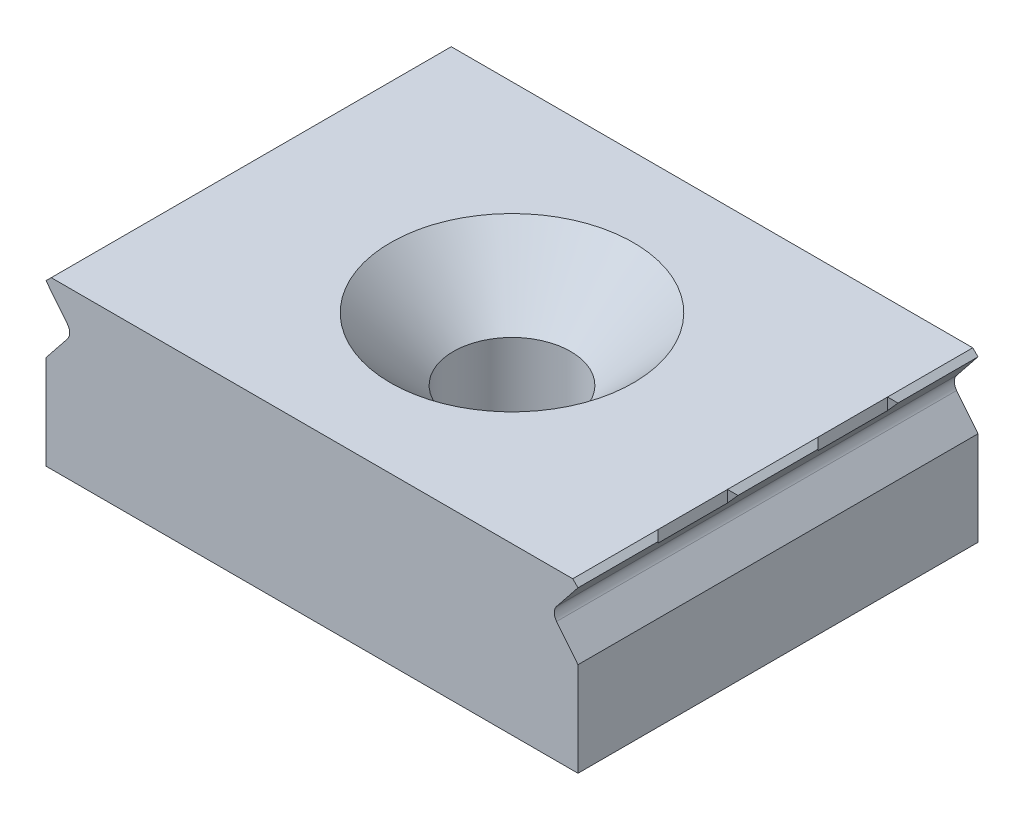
from build123d import *

# Parameters (mm, degrees)
SKETCH1_W           = 25.4
SKETCH1_H           = 19.1
BOSS_EXTRUDE1_DEPTH = 3.96
CHAMFER1_SIZE       = 0.25
CUT_EXTRUDE1_DEPTH  = 19.1
CUT_EXTRUDE2_DEPTH  = 1
LPATTERN1_COUNT     = 2
LPATTERN1_PITCH     = 7.64
SKETCH4_R           = 2.8
CUT_EXTRUDE3_DEPTH  = 7.92
CHAMFER2_SIZE       = 3


with BuildPart() as part:
    # Sketch1 → Boss-Extrude1 (new, symmetric)
    with BuildSketch(Plane(origin=(0, 0, 0), x_dir=(1, 0, 0), z_dir=(0, 1, 0))):
        Rectangle(SKETCH1_W, SKETCH1_H)
    extrude(amount=BOSS_EXTRUDE1_DEPTH, both=True)

    # Chamfer1
    chamfer1_edges = [part.edges().sort_by_distance(p)[0] for p in [
        (12.7, 3.96, 0),
        (-12.7, 3.96, 0),
    ]]
    chamfer(chamfer1_edges, length=CHAMFER1_SIZE)

    # Sketch2 → Cut-Extrude1 (cut)
    with BuildSketch(Plane.XY.offset(9.55)):
        with BuildLine():
            Line((-12.7, 3.71), (-12.7, 0.53))
            Line((-12.7, 0.53), (-11.679245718, 1.807952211))
            ThreePointArc((-11.679245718, 1.807952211), (-11.569919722, 2.12), (-11.679245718, 2.432047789))
            Line((-11.679245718, 2.432047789), (-12.7, 3.71))
        make_face()
    cut_extrude1 = extrude(amount=-CUT_EXTRUDE1_DEPTH, mode=Mode.SUBTRACT)

    # Mirror1: Cut-Extrude1 across plane
    add(cut_extrude1.mirror(Plane(origin=(0, 0, 0), x_dir=(0, 0, 1), z_dir=(1, 0, 0))), mode=Mode.SUBTRACT)

    # Sketch3 → Cut-Extrude2 (cut)
    with BuildSketch(Plane(origin=(0, 3.96, 0), x_dir=(1, 0, 0), z_dir=(0, 1, 0))):
        Polygon((-12.7, -5.73), (-12.7, -1.91), (-12.45, -2.16), (-12.45, -5.48), align=None)
        Polygon((12.7, -5.73), (12.45, -5.479999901), (12.45, -2.159999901), (12.7, -1.91), align=None)
    cut_extrude2 = extrude(amount=-CUT_EXTRUDE2_DEPTH, mode=Mode.SUBTRACT)

    # LPattern1: Cut-Extrude2 ×2
    with Locations(*[(0, 0, -i * LPATTERN1_PITCH) for i in range(1, LPATTERN1_COUNT)]):
        add(cut_extrude2, mode=Mode.SUBTRACT)

    # Sketch4 → Cut-Extrude3 (cut)
    with BuildSketch(Plane(origin=(0, 3.96, 0), x_dir=(1, 0, 0), z_dir=(0, 1, 0))):
        with Locations(Location((0, 0, 0), (0, 0, 270))):
            Circle(SKETCH4_R)
    extrude(amount=-CUT_EXTRUDE3_DEPTH, mode=Mode.SUBTRACT)

    # Chamfer2
    chamfer2_edges = [part.edges().sort_by_distance(p)[0] for p in [
        (0, 3.96, -2.8),
    ]]
    chamfer(chamfer2_edges, length=CHAMFER2_SIZE)


solid = part.part
